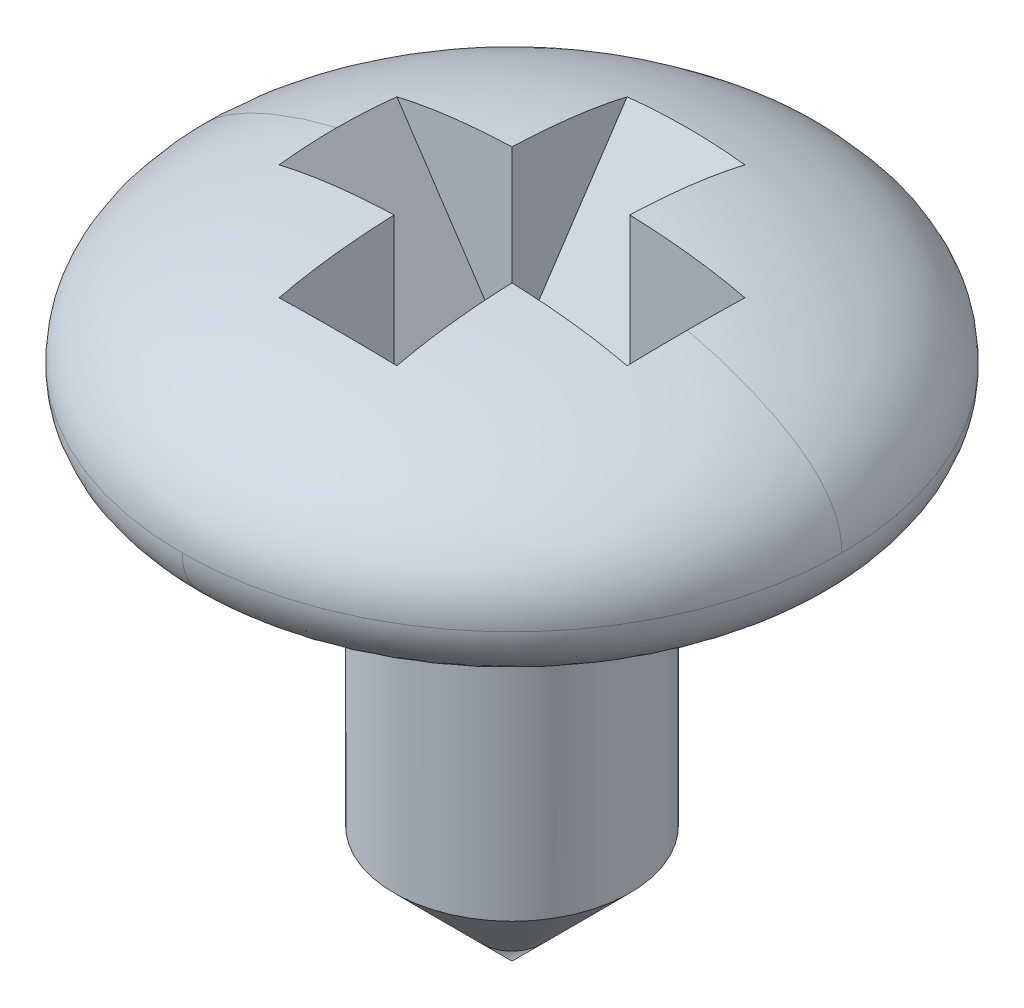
ISO-10303-21;
HEADER;
FILE_DESCRIPTION(('STEP AP214'),'2;1');
FILE_NAME('part.step','',(''),(''),'','','');
FILE_SCHEMA(('AUTOMOTIVE_DESIGN { 1 0 10303 214 1 1 1 1 }'));
ENDSEC;
DATA;
#1=APPLICATION_CONTEXT('core data for automotive mechanical design processes');
#2=APPLICATION_PROTOCOL_DEFINITION('international standard','automotive_design',2000,#1);
#3=PRODUCT_CONTEXT('',#1,'mechanical');
#4=PRODUCT('Part','Part','',(#3));
#5=PRODUCT_RELATED_PRODUCT_CATEGORY('part','',(#4));
#6=PRODUCT_DEFINITION_FORMATION('','',#4);
#7=PRODUCT_DEFINITION_CONTEXT('part definition',#1,'design');
#8=PRODUCT_DEFINITION('design','',#6,#7);
#9=PRODUCT_DEFINITION_SHAPE('','',#8);
#10=(LENGTH_UNIT() NAMED_UNIT(*) SI_UNIT(.MILLI.,.METRE.));
#11=(NAMED_UNIT(*) PLANE_ANGLE_UNIT() SI_UNIT($,.RADIAN.));
#12=(NAMED_UNIT(*) SI_UNIT($,.STERADIAN.) SOLID_ANGLE_UNIT());
#13=UNCERTAINTY_MEASURE_WITH_UNIT(LENGTH_MEASURE(1.E-05),#10,'distance_accuracy_value','');
#14=(GEOMETRIC_REPRESENTATION_CONTEXT(3) GLOBAL_UNCERTAINTY_ASSIGNED_CONTEXT((#13)) GLOBAL_UNIT_ASSIGNED_CONTEXT((#10,
#11,#12)) REPRESENTATION_CONTEXT('',''));
#15=CARTESIAN_POINT('',(0.,0.,0.));
#16=DIRECTION('',(0.,0.,1.));
#17=DIRECTION('',(1.,0.,0.));
#18=AXIS2_PLACEMENT_3D('',#15,#16,#17);
#19=CARTESIAN_POINT('',(0.5,6.390485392,1.482802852));
#20=DIRECTION('',(1.,0.,0.));
#21=DIRECTION('',(0.,0.,-1.));
#22=AXIS2_PLACEMENT_3D('',#19,#20,#21);
#23=PLANE('',#22);
#24=DIRECTION('',(0.,1.,0.));
#25=VECTOR('',#24,1.);
#26=CARTESIAN_POINT('',(0.5,7.192883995,0.5));
#27=LINE('',#26,#25);
#28=CARTESIAN_POINT('',(0.5,6.4000000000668,0.5));
#29=VERTEX_POINT('',#28);
#30=CARTESIAN_POINT('',(0.50000000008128,7.98576798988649,0.5));
#31=VERTEX_POINT('',#30);
#32=EDGE_CURVE('E110',#29,#31,#27,.T.);
#33=ORIENTED_EDGE('',*,*,#32,.F.);
#34=DIRECTION('',(0.,0.832050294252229,0.554700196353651));
#35=VECTOR('',#34,1.);
#36=CARTESIAN_POINT('',(0.5,7.1475827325,0.9983884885));
#37=LINE('',#36,#35);
#38=CARTESIAN_POINT('',(0.5,7.86541180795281,1.47694120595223));
#39=VERTEX_POINT('',#38);
#40=EDGE_CURVE('E130',#29,#39,#37,.T.);
#41=ORIENTED_EDGE('',*,*,#40,.T.);
#42=CARTESIAN_POINT('',(0.5,7.98576799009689,0.500000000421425));
#43=CARTESIAN_POINT('',(0.5,7.98363335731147,0.554809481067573));
#44=CARTESIAN_POINT('',(0.5,7.98099329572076,0.6096059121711));
#45=CARTESIAN_POINT('',(0.5,7.97444299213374,0.719017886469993));
#46=CARTESIAN_POINT('',(0.5,7.97053515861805,0.773633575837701));
#47=CARTESIAN_POINT('',(0.5,7.96118969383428,0.882669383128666));
#48=CARTESIAN_POINT('',(0.5,7.95575395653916,0.937089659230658));
#49=CARTESIAN_POINT('',(0.5,7.94310003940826,1.04574591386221));
#50=CARTESIAN_POINT('',(0.5,7.93588117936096,1.0999818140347));
#51=CARTESIAN_POINT('',(0.5,7.91942898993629,1.20819835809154));
#52=CARTESIAN_POINT('',(0.5,7.91019394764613,1.26217874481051));
#53=CARTESIAN_POINT('',(0.5,7.88950995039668,1.36984464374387));
#54=CARTESIAN_POINT('',(0.5,7.87805581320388,1.42352915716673));
#55=CARTESIAN_POINT('',(0.5,7.86541180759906,1.47694120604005));
#56=B_SPLINE_CURVE_WITH_KNOTS('',3,(#42,#43,#44,#45,#46,#47,#48,#49,#50,#51,#52,#53,#54,#55),
.UNSPECIFIED.,.F.,.F.,(4,2,2,2,2,2,4),(0.,0.164560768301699,0.328810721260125,0.492857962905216,
0.6569678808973,0.821217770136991,0.985855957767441),.UNSPECIFIED.);
#57=EDGE_CURVE('E20',#31,#39,#56,.T.);
#58=ORIENTED_EDGE('',*,*,#57,.F.);
#59=EDGE_LOOP('',(#33,#41,#58));
#60=FACE_BOUND('',#59,.T.);
#61=ADVANCED_FACE('F15',(#60),#23,.F.);
#62=CARTESIAN_POINT('',(-0.5,7.895165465,1.496776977));
#63=DIRECTION('',(0.,-0.554700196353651,0.832050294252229));
#64=DIRECTION('',(0.,-0.832050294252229,-0.554700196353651));
#65=AXIS2_PLACEMENT_3D('',#62,#63,#64);
#66=PLANE('',#65);
#67=ORIENTED_EDGE('',*,*,#40,.F.);
#68=DIRECTION('',(1.,0.,0.));
#69=VECTOR('',#68,1.);
#70=CARTESIAN_POINT('',(0.,6.4,0.5));
#71=LINE('',#70,#69);
#72=CARTESIAN_POINT('',(-0.5,6.40000000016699,0.499999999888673));
#73=VERTEX_POINT('',#72);
#74=EDGE_CURVE('E132',#73,#29,#71,.T.);
#75=ORIENTED_EDGE('',*,*,#74,.F.);
#76=DIRECTION('',(0.,-0.832050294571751,-0.554700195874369));
#77=VECTOR('',#76,1.);
#78=CARTESIAN_POINT('',(-0.5,7.86541180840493,1.47694120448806));
#79=LINE('',#78,#77);
#80=CARTESIAN_POINT('',(-0.49999999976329,7.86541180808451,1.47694120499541));
#81=VERTEX_POINT('',#80);
#82=EDGE_CURVE('E428',#81,#73,#79,.T.);
#83=ORIENTED_EDGE('',*,*,#82,.F.);
#84=CARTESIAN_POINT('',(0.499999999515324,7.86541180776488,1.47694120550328));
#85=CARTESIAN_POINT('',(0.444503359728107,7.86924704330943,1.47949802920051));
#86=CARTESIAN_POINT('',(0.388941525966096,7.87240994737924,1.48160663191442));
#87=CARTESIAN_POINT('',(0.277815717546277,7.87743427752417,1.48495618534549));
#88=CARTESIAN_POINT('',(0.222251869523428,7.87929763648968,1.48619842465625));
#89=CARTESIAN_POINT('',(0.111125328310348,7.88177630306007,1.48785086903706));
#90=CARTESIAN_POINT('',(0.0555626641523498,7.8823925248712,1.48826168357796));
#91=CARTESIAN_POINT('',(-0.0555626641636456,7.88239252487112,1.4882616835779));
#92=CARTESIAN_POINT('',(-0.111125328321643,7.88177630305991,1.48785086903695));
#93=CARTESIAN_POINT('',(-0.222251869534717,7.87929763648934,1.48619842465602));
#94=CARTESIAN_POINT('',(-0.277815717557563,7.87743427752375,1.48495618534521));
#95=CARTESIAN_POINT('',(-0.38894152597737,7.87240994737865,1.48160663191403));
#96=CARTESIAN_POINT('',(-0.444503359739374,7.86924704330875,1.47949802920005));
#97=CARTESIAN_POINT('',(-0.499999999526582,7.8654118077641,1.47694120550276));
#98=B_SPLINE_CURVE_WITH_KNOTS('',3,(#84,#85,#86,#87,#88,#89,#90,#91,#92,#93,#94,#95,#96,#97),
.UNSPECIFIED.,.F.,.F.,(4,2,2,2,2,2,4),(0.,0.16705445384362,0.333859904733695,0.50054303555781,
0.667226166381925,0.834031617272,1.00108607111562),.UNSPECIFIED.);
#99=EDGE_CURVE('E138',#39,#81,#98,.T.);
#100=ORIENTED_EDGE('',*,*,#99,.F.);
#101=EDGE_LOOP('',(#67,#75,#83,#100));
#102=FACE_BOUND('',#101,.T.);
#103=ADVANCED_FACE('F448',(#102),#66,.F.);
#104=CARTESIAN_POINT('',(-0.5,6.390485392,1.482802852));
#105=DIRECTION('',(1.,0.,0.));
#106=DIRECTION('',(0.,0.,-1.));
#107=AXIS2_PLACEMENT_3D('',#104,#105,#106);
#108=PLANE('',#107);
#109=DIRECTION('',(0.,-1.,0.));
#110=VECTOR('',#109,1.);
#111=CARTESIAN_POINT('',(-0.5,7.192883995,0.5));
#112=LINE('',#111,#110);
#113=CARTESIAN_POINT('',(-0.5,7.98576798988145,0.500000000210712));
#114=VERTEX_POINT('',#113);
#115=EDGE_CURVE('E414',#114,#73,#112,.T.);
#116=ORIENTED_EDGE('',*,*,#115,.F.);
#117=CARTESIAN_POINT('',(-0.5,7.98576799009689,0.500000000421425));
#118=CARTESIAN_POINT('',(-0.5,7.98363335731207,0.554809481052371));
#119=CARTESIAN_POINT('',(-0.5,7.98099329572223,0.609605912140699));
#120=CARTESIAN_POINT('',(-0.5,7.97444299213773,0.719017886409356));
#121=CARTESIAN_POINT('',(-0.5,7.97053515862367,0.773633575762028));
#122=CARTESIAN_POINT('',(-0.5,7.96118969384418,0.882669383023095));
#123=CARTESIAN_POINT('',(-0.5,7.95575395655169,0.937089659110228));
#124=CARTESIAN_POINT('',(-0.5,7.94310003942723,1.04574591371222));
#125=CARTESIAN_POINT('',(-0.5,7.93588117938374,1.09998181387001));
#126=CARTESIAN_POINT('',(-0.5,7.91942898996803,1.20819835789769));
#127=CARTESIAN_POINT('',(-0.5,7.91019394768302,1.26217874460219));
#128=CARTESIAN_POINT('',(-0.5,7.88950995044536,1.3698446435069));
#129=CARTESIAN_POINT('',(-0.5,7.87805581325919,1.42352915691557));
#130=CARTESIAN_POINT('',(-0.499999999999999,7.86541180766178,1.47694120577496));
#131=B_SPLINE_CURVE_WITH_KNOTS('',3,(#117,#118,#119,#120,#121,#122,#123,#124,#125,#126,#127,
#128,#129,#130),.UNSPECIFIED.,.F.,.F.,(4,2,2,2,2,2,4),(0.,0.164560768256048,0.328810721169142,
0.492857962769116,0.656967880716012,0.821217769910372,0.985855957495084),.UNSPECIFIED.);
#132=EDGE_CURVE('E425',#114,#81,#131,.T.);
#133=ORIENTED_EDGE('',*,*,#132,.T.);
#134=ORIENTED_EDGE('',*,*,#82,.T.);
#135=EDGE_LOOP('',(#116,#133,#134));
#136=FACE_BOUND('',#135,.T.);
#137=ADVANCED_FACE('F445',(#136),#108,.T.);
#138=CARTESIAN_POINT('',(-0.5,6.390485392,0.5));
#139=DIRECTION('',(0.,0.,-1.));
#140=DIRECTION('',(-1.,0.,0.));
#141=AXIS2_PLACEMENT_3D('',#138,#139,#140);
#142=PLANE('',#141);
#143=ORIENTED_EDGE('',*,*,#115,.T.);
#144=DIRECTION('',(-0.554700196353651,0.832050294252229,0.));
#145=VECTOR('',#144,1.);
#146=CARTESIAN_POINT('',(-0.9983884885,7.1475827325,0.5));
#147=LINE('',#146,#145);
#148=CARTESIAN_POINT('',(-1.47694120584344,7.86541180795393,0.5));
#149=VERTEX_POINT('',#148);
#150=EDGE_CURVE('E410',#73,#149,#147,.T.);
#151=ORIENTED_EDGE('',*,*,#150,.T.);
#152=CARTESIAN_POINT('',(-1.47694120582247,7.8654118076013,0.5));
#153=CARTESIAN_POINT('',(-1.42352915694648,7.87805581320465,0.5));
#154=CARTESIAN_POINT('',(-1.36984464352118,7.88950995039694,0.5));
#155=CARTESIAN_POINT('',(-1.26217874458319,7.91019394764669,0.5));
#156=CARTESIAN_POINT('',(-1.20819835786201,7.91942898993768,0.5));
#157=CARTESIAN_POINT('',(-1.09998181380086,7.93588117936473,0.5));
#158=CARTESIAN_POINT('',(-1.04574591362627,7.94310003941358,0.5));
#159=CARTESIAN_POINT('',(-0.937089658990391,7.9557539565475,0.5));
#160=CARTESIAN_POINT('',(-0.882669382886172,7.96118969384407,0.5));
#161=CARTESIAN_POINT('',(-0.773633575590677,7.97053515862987,0.5));
#162=CARTESIAN_POINT('',(-0.719017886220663,7.97444299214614,0.500000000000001));
#163=CARTESIAN_POINT('',(-0.609605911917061,7.98099329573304,0.499999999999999));
#164=CARTESIAN_POINT('',(-0.554809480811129,7.98363335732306,0.499999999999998));
#165=CARTESIAN_POINT('',(-0.500000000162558,7.98576799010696,0.499999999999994));
#166=B_SPLINE_CURVE_WITH_KNOTS('',3,(#152,#153,#154,#155,#156,#157,#158,#159,#160,#161,#162,
#163,#164,#165),.UNSPECIFIED.,.F.,.F.,(4,2,2,2,2,2,4),(0.,0.164638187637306,0.328888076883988,
0.492997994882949,0.657045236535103,0.82129518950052,0.985855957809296),.UNSPECIFIED.);
#167=EDGE_CURVE('E417',#149,#114,#166,.T.);
#168=ORIENTED_EDGE('',*,*,#167,.T.);
#169=EDGE_LOOP('',(#143,#151,#168));
#170=FACE_BOUND('',#169,.T.);
#171=ADVANCED_FACE('F442',(#170),#142,.T.);
#172=CARTESIAN_POINT('',(-1.496776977,7.895165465,-0.5));
#173=DIRECTION('',(-0.832050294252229,-0.554700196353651,0.));
#174=DIRECTION('',(0.554700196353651,-0.832050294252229,0.));
#175=AXIS2_PLACEMENT_3D('',#172,#173,#174);
#176=PLANE('',#175);
#177=CARTESIAN_POINT('',(-1.47694120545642,7.86541180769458,0.49999999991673));
#178=CARTESIAN_POINT('',(-1.47821963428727,7.86732945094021,0.472277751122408));
#179=CARTESIAN_POINT('',(-1.47938521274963,7.86907781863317,0.444538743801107));
#180=CARTESIAN_POINT('',(-1.48149537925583,7.87224306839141,0.389044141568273));
#181=CARTESIAN_POINT('',(-1.48244005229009,7.87366007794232,0.361288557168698));
#182=CARTESIAN_POINT('',(-1.48411394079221,7.87617091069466,0.305761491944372));
#183=CARTESIAN_POINT('',(-1.4848431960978,7.87726479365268,0.277990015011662));
#184=CARTESIAN_POINT('',(-1.48609040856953,7.87913561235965,0.222431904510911));
#185=CARTESIAN_POINT('',(-1.48660836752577,7.87991255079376,0.194645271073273));
#186=CARTESIAN_POINT('',(-1.48743609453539,7.88115414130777,0.139056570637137));
#187=CARTESIAN_POINT('',(-1.4877458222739,7.88161873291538,0.111254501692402));
#188=CARTESIAN_POINT('',(-1.48815854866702,7.88223782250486,0.0556349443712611));
#189=CARTESIAN_POINT('',(-1.48826146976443,7.88239220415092,0.0278174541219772));
#190=CARTESIAN_POINT('',(-1.48826168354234,7.88239252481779,0.));
#191=B_SPLINE_CURVE_WITH_KNOTS('',3,(#177,#178,#179,#180,#181,#182,#183,#184,#185,#186,#187,
#188,#189,#190),.UNSPECIFIED.,.F.,.F.,(4,2,2,2,2,2,4),(0.,0.0834526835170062,0.166873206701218,
0.25027829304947,0.333682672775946,0.417103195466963,0.500554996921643),.UNSPECIFIED.);
#192=CARTESIAN_POINT('',(-1.48826168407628,7.88239252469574,0.));
#193=VERTEX_POINT('',#192);
#194=EDGE_CURVE('E413',#149,#193,#191,.T.);
#195=ORIENTED_EDGE('',*,*,#194,.F.);
#196=ORIENTED_EDGE('',*,*,#150,.F.);
#197=DIRECTION('',(0.,0.,1.));
#198=VECTOR('',#197,1.);
#199=CARTESIAN_POINT('',(-0.5,6.4,0.));
#200=LINE('',#199,#198);
#201=CARTESIAN_POINT('',(-0.5,6.4,-0.5));
#202=VERTEX_POINT('',#201);
#203=EDGE_CURVE('E142',#202,#73,#200,.T.);
#204=ORIENTED_EDGE('',*,*,#203,.F.);
#205=DIRECTION('',(0.554700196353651,-0.832050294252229,0.));
#206=VECTOR('',#205,1.);
#207=CARTESIAN_POINT('',(-1.496776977,7.895165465,-0.5));
#208=LINE('',#207,#206);
#209=CARTESIAN_POINT('',(-1.47694120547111,7.86541180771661,-0.499999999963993));
#210=VERTEX_POINT('',#209);
#211=EDGE_CURVE('E246',#202,#210,#208,.F.);
#212=ORIENTED_EDGE('',*,*,#211,.T.);
#213=CARTESIAN_POINT('',(-1.48826168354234,7.88239252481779,0.));
#214=CARTESIAN_POINT('',(-1.48826146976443,7.88239220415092,-0.0278174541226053));
#215=CARTESIAN_POINT('',(-1.48815854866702,7.88223782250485,-0.0556349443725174));
#216=CARTESIAN_POINT('',(-1.48774582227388,7.88161873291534,-0.111254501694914));
#217=CARTESIAN_POINT('',(-1.48743609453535,7.88115414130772,-0.139056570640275));
#218=CARTESIAN_POINT('',(-1.4866083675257,7.87991255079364,-0.194645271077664));
#219=CARTESIAN_POINT('',(-1.48609040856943,7.87913561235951,-0.222431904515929));
#220=CARTESIAN_POINT('',(-1.48484319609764,7.87726479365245,-0.277990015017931));
#221=CARTESIAN_POINT('',(-1.48411394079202,7.87617091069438,-0.305761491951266));
#222=CARTESIAN_POINT('',(-1.48244005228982,7.87366007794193,-0.36128855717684));
#223=CARTESIAN_POINT('',(-1.48149537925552,7.87224306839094,-0.389044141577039));
#224=CARTESIAN_POINT('',(-1.47938521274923,7.86907781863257,-0.44453874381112));
#225=CARTESIAN_POINT('',(-1.47821963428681,7.86732945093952,-0.472277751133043));
#226=CARTESIAN_POINT('',(-1.4769412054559,7.8654118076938,-0.499999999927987));
#227=B_SPLINE_CURVE_WITH_KNOTS('',3,(#213,#214,#215,#216,#217,#218,#219,#220,#221,#222,#223,
#224,#225,#226),.UNSPECIFIED.,.F.,.F.,(4,2,2,2,2,2,4),(0.,0.0834518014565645,0.166872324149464,
0.25027670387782,0.333681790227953,0.417102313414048,0.500554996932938),.UNSPECIFIED.);
#228=EDGE_CURVE('E464',#193,#210,#227,.T.);
#229=ORIENTED_EDGE('',*,*,#228,.F.);
#230=EDGE_LOOP('',(#195,#196,#204,#212,#229));
#231=FACE_BOUND('',#230,.T.);
#232=ADVANCED_FACE('F252',(#231),#176,.F.);
#233=CARTESIAN_POINT('',(-0.5,6.390485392,-0.5));
#234=DIRECTION('',(0.,0.,-1.));
#235=DIRECTION('',(-1.,0.,0.));
#236=AXIS2_PLACEMENT_3D('',#233,#234,#235);
#237=PLANE('',#236);
#238=CARTESIAN_POINT('',(-1.47694120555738,7.86541180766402,-0.5));
#239=CARTESIAN_POINT('',(-1.42352915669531,7.87805581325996,-0.5));
#240=CARTESIAN_POINT('',(-1.36984464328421,7.88950995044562,-0.5));
#241=CARTESIAN_POINT('',(-1.26217874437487,7.91019394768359,-0.5));
#242=CARTESIAN_POINT('',(-1.20819835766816,7.91942898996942,-0.5));
#243=CARTESIAN_POINT('',(-1.09998181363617,7.93588117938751,-0.5));
#244=CARTESIAN_POINT('',(-1.04574591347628,7.94310003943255,-0.5));
#245=CARTESIAN_POINT('',(-0.937089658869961,7.95575395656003,-0.5));
#246=CARTESIAN_POINT('',(-0.882669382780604,7.96118969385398,-0.5));
#247=CARTESIAN_POINT('',(-0.773633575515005,7.9705351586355,-0.5));
#248=CARTESIAN_POINT('',(-0.719017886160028,7.97444299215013,-0.500000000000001));
#249=CARTESIAN_POINT('',(-0.609605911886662,7.98099329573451,-0.499999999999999));
#250=CARTESIAN_POINT('',(-0.554809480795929,7.98363335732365,-0.499999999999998));
#251=CARTESIAN_POINT('',(-0.500000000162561,7.98576799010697,-0.499999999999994));
#252=B_SPLINE_CURVE_WITH_KNOTS('',3,(#238,#239,#240,#241,#242,#243,#244,#245,#246,#247,#248,
#249,#250,#251),.UNSPECIFIED.,.F.,.F.,(4,2,2,2,2,2,4),(0.,0.164638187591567,0.328888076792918,
0.492997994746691,0.657045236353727,0.821295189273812,0.985855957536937),.UNSPECIFIED.);
#253=CARTESIAN_POINT('',(-0.500000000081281,7.98576798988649,-0.5));
#254=VERTEX_POINT('',#253);
#255=EDGE_CURVE('E239',#210,#254,#252,.T.);
#256=ORIENTED_EDGE('',*,*,#255,.F.);
#257=ORIENTED_EDGE('',*,*,#211,.F.);
#258=DIRECTION('',(0.,-1.,0.));
#259=VECTOR('',#258,1.);
#260=CARTESIAN_POINT('',(-0.5,7.192883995,-0.5));
#261=LINE('',#260,#259);
#262=EDGE_CURVE('E245',#254,#202,#261,.T.);
#263=ORIENTED_EDGE('',*,*,#262,.F.);
#264=EDGE_LOOP('',(#256,#257,#263));
#265=FACE_BOUND('',#264,.T.);
#266=ADVANCED_FACE('F247',(#265),#237,.F.);
#267=CARTESIAN_POINT('',(-0.5,6.390485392,-0.5));
#268=DIRECTION('',(1.,0.,0.));
#269=DIRECTION('',(0.,0.,-1.));
#270=AXIS2_PLACEMENT_3D('',#267,#268,#269);
#271=PLANE('',#270);
#272=DIRECTION('',(0.,0.832050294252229,-0.554700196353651));
#273=VECTOR('',#272,1.);
#274=CARTESIAN_POINT('',(-0.5,7.1475827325,-0.9983884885));
#275=LINE('',#274,#273);
#276=CARTESIAN_POINT('',(-0.5,7.86541180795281,-1.47694120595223));
#277=VERTEX_POINT('',#276);
#278=EDGE_CURVE('E403',#202,#277,#275,.T.);
#279=ORIENTED_EDGE('',*,*,#278,.T.);
#280=CARTESIAN_POINT('',(-0.5,7.86541180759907,-1.47694120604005));
#281=CARTESIAN_POINT('',(-0.5,7.87805581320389,-1.42352915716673));
#282=CARTESIAN_POINT('',(-0.5,7.88950995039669,-1.36984464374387));
#283=CARTESIAN_POINT('',(-0.5,7.91019394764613,-1.26217874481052));
#284=CARTESIAN_POINT('',(-0.5,7.91942898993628,-1.20819835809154));
#285=CARTESIAN_POINT('',(-0.5,7.93588117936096,-1.0999818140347));
#286=CARTESIAN_POINT('',(-0.5,7.94310003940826,-1.04574591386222));
#287=CARTESIAN_POINT('',(-0.5,7.95575395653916,-0.937089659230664));
#288=CARTESIAN_POINT('',(-0.5,7.96118969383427,-0.882669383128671));
#289=CARTESIAN_POINT('',(-0.5,7.97053515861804,-0.773633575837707));
#290=CARTESIAN_POINT('',(-0.500000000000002,7.97444299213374,-0.719017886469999));
#291=CARTESIAN_POINT('',(-0.499999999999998,7.98099329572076,-0.609605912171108));
#292=CARTESIAN_POINT('',(-0.499999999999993,7.98363335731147,-0.55480948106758));
#293=CARTESIAN_POINT('',(-0.499999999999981,7.98576799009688,-0.500000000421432));
#294=B_SPLINE_CURVE_WITH_KNOTS('',3,(#280,#281,#282,#283,#284,#285,#286,#287,#288,#289,#290,
#291,#292,#293),.UNSPECIFIED.,.F.,.F.,(4,2,2,2,2,2,4),(0.,0.164638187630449,0.328888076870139,
0.492997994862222,0.657045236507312,0.821295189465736,0.985855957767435),.UNSPECIFIED.);
#295=EDGE_CURVE('E233',#277,#254,#294,.T.);
#296=ORIENTED_EDGE('',*,*,#295,.T.);
#297=ORIENTED_EDGE('',*,*,#262,.T.);
#298=EDGE_LOOP('',(#279,#296,#297));
#299=FACE_BOUND('',#298,.T.);
#300=ADVANCED_FACE('F251',(#299),#271,.T.);
#301=CARTESIAN_POINT('',(-0.5,6.4,-0.5));
#302=DIRECTION('',(0.,-0.554700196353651,-0.832050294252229));
#303=DIRECTION('',(0.,0.832050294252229,-0.554700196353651));
#304=AXIS2_PLACEMENT_3D('',#301,#302,#303);
#305=PLANE('',#304);
#306=ORIENTED_EDGE('',*,*,#278,.F.);
#307=DIRECTION('',(-1.,0.,0.));
#308=VECTOR('',#307,1.);
#309=CARTESIAN_POINT('',(0.,6.4,-0.5));
#310=LINE('',#309,#308);
#311=CARTESIAN_POINT('',(0.5,6.4,-0.5));
#312=VERTEX_POINT('',#311);
#313=EDGE_CURVE('E285',#312,#202,#310,.T.);
#314=ORIENTED_EDGE('',*,*,#313,.F.);
#315=DIRECTION('',(0.,0.832050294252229,-0.554700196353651));
#316=VECTOR('',#315,1.);
#317=CARTESIAN_POINT('',(0.5,6.4,-0.5));
#318=LINE('',#317,#316);
#319=CARTESIAN_POINT('',(0.499999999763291,7.86541180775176,-1.47694120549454));
#320=VERTEX_POINT('',#319);
#321=EDGE_CURVE('E568',#312,#320,#318,.T.);
#322=ORIENTED_EDGE('',*,*,#321,.T.);
#323=CARTESIAN_POINT('',(-0.499999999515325,7.86541180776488,-1.47694120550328));
#324=CARTESIAN_POINT('',(-0.444503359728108,7.86924704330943,-1.47949802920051));
#325=CARTESIAN_POINT('',(-0.388941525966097,7.87240994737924,-1.48160663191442));
#326=CARTESIAN_POINT('',(-0.277815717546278,7.87743427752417,-1.48495618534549));
#327=CARTESIAN_POINT('',(-0.222251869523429,7.87929763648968,-1.48619842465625));
#328=CARTESIAN_POINT('',(-0.111125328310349,7.88177630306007,-1.48785086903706));
#329=CARTESIAN_POINT('',(-0.0555626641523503,7.8823925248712,-1.48826168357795));
#330=CARTESIAN_POINT('',(0.0555626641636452,7.88239252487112,-1.4882616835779));
#331=CARTESIAN_POINT('',(0.111125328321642,7.88177630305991,-1.48785086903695));
#332=CARTESIAN_POINT('',(0.222251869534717,7.87929763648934,-1.48619842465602));
#333=CARTESIAN_POINT('',(0.277815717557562,7.87743427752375,-1.48495618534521));
#334=CARTESIAN_POINT('',(0.38894152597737,7.87240994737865,-1.48160663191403));
#335=CARTESIAN_POINT('',(0.444503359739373,7.86924704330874,-1.47949802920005));
#336=CARTESIAN_POINT('',(0.499999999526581,7.8654118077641,-1.47694120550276));
#337=B_SPLINE_CURVE_WITH_KNOTS('',3,(#323,#324,#325,#326,#327,#328,#329,#330,#331,#332,#333,
#334,#335,#336),.UNSPECIFIED.,.F.,.F.,(4,2,2,2,2,2,4),(0.,0.16705445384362,0.333859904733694,
0.50054303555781,0.667226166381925,0.834031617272,1.00108607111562),.UNSPECIFIED.);
#338=EDGE_CURVE('E227',#277,#320,#337,.T.);
#339=ORIENTED_EDGE('',*,*,#338,.F.);
#340=EDGE_LOOP('',(#306,#314,#322,#339));
#341=FACE_BOUND('',#340,.T.);
#342=ADVANCED_FACE('F258',(#341),#305,.F.);
#343=CARTESIAN_POINT('',(0.,2.5,0.));
#344=DIRECTION('',(0.,1.,0.));
#345=DIRECTION('',(-1.,0.,0.));
#346=AXIS2_PLACEMENT_3D('',#343,#344,#345);
#347=CONICAL_SURFACE('',#346,0.,0.785398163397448);
#348=CARTESIAN_POINT('',(0.,2.5,0.));
#349=VERTEX_POINT('',#348);
#350=VERTEX_LOOP('',#349);
#351=FACE_BOUND('',#350,.T.);
#352=CARTESIAN_POINT('',(0.,3.5,0.));
#353=DIRECTION('',(0.,-1.,0.));
#354=DIRECTION('',(0.,0.,-1.));
#355=AXIS2_PLACEMENT_3D('',#352,#353,#354);
#356=CIRCLE('',#355,1.);
#357=CARTESIAN_POINT('',(0.,3.5,-1.));
#358=VERTEX_POINT('',#357);
#359=EDGE_CURVE('E128',#358,#358,#356,.T.);
#360=ORIENTED_EDGE('',*,*,#359,.T.);
#361=EDGE_LOOP('',(#360));
#362=FACE_BOUND('',#361,.T.);
#363=ADVANCED_FACE('F262',(#351,#362),#347,.T.);
#364=CARTESIAN_POINT('',(0.5,6.390485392,-0.5));
#365=DIRECTION('',(1.,0.,0.));
#366=DIRECTION('',(0.,0.,-1.));
#367=AXIS2_PLACEMENT_3D('',#364,#365,#366);
#368=PLANE('',#367);
#369=ORIENTED_EDGE('',*,*,#321,.F.);
#370=DIRECTION('',(0.,1.,0.));
#371=VECTOR('',#370,1.);
#372=CARTESIAN_POINT('',(0.5,7.192883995,-0.5));
#373=LINE('',#372,#371);
#374=CARTESIAN_POINT('',(0.5,7.98576798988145,-0.500000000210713));
#375=VERTEX_POINT('',#374);
#376=EDGE_CURVE('E127',#312,#375,#373,.T.);
#377=ORIENTED_EDGE('',*,*,#376,.T.);
#378=CARTESIAN_POINT('',(0.5,7.86541180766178,-1.47694120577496));
#379=CARTESIAN_POINT('',(0.5,7.8780558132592,-1.42352915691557));
#380=CARTESIAN_POINT('',(0.5,7.88950995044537,-1.3698446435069));
#381=CARTESIAN_POINT('',(0.5,7.91019394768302,-1.26217874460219));
#382=CARTESIAN_POINT('',(0.5,7.91942898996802,-1.20819835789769));
#383=CARTESIAN_POINT('',(0.5,7.93588117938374,-1.09998181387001));
#384=CARTESIAN_POINT('',(0.5,7.94310003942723,-1.04574591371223));
#385=CARTESIAN_POINT('',(0.5,7.95575395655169,-0.937089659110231));
#386=CARTESIAN_POINT('',(0.5,7.96118969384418,-0.8826693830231));
#387=CARTESIAN_POINT('',(0.5,7.97053515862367,-0.773633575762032));
#388=CARTESIAN_POINT('',(0.500000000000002,7.97444299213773,-0.719017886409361));
#389=CARTESIAN_POINT('',(0.499999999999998,7.98099329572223,-0.609605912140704));
#390=CARTESIAN_POINT('',(0.499999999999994,7.98363335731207,-0.554809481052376));
#391=CARTESIAN_POINT('',(0.499999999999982,7.98576799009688,-0.50000000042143));
#392=B_SPLINE_CURVE_WITH_KNOTS('',3,(#378,#379,#380,#381,#382,#383,#384,#385,#386,#387,#388,
#389,#390,#391),.UNSPECIFIED.,.F.,.F.,(4,2,2,2,2,2,4),(0.,0.164638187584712,0.328888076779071,
0.492997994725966,0.657045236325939,0.821295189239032,0.98585595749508),.UNSPECIFIED.);
#393=EDGE_CURVE('E219',#320,#375,#392,.T.);
#394=ORIENTED_EDGE('',*,*,#393,.F.);
#395=EDGE_LOOP('',(#369,#377,#394));
#396=FACE_BOUND('',#395,.T.);
#397=ADVANCED_FACE('F264',(#396),#368,.F.);
#398=CARTESIAN_POINT('',(0.,6.4,0.));
#399=DIRECTION('',(0.,-1.,0.));
#400=DIRECTION('',(0.,0.,-1.));
#401=AXIS2_PLACEMENT_3D('',#398,#399,#400);
#402=CYLINDRICAL_SURFACE('',#401,1.);
#403=ORIENTED_EDGE('',*,*,#359,.F.);
#404=EDGE_LOOP('',(#403));
#405=FACE_BOUND('',#404,.T.);
#406=CARTESIAN_POINT('',(0.,6.4,0.));
#407=DIRECTION('',(0.,-1.,0.));
#408=DIRECTION('',(0.,0.,-1.));
#409=AXIS2_PLACEMENT_3D('',#406,#407,#408);
#410=CIRCLE('',#409,1.);
#411=CARTESIAN_POINT('',(0.,6.4,-1.));
#412=VERTEX_POINT('',#411);
#413=EDGE_CURVE('E303',#412,#412,#410,.F.);
#414=ORIENTED_EDGE('',*,*,#413,.F.);
#415=EDGE_LOOP('',(#414));
#416=FACE_BOUND('',#415,.T.);
#417=ADVANCED_FACE('F268',(#405,#416),#402,.T.);
#418=CARTESIAN_POINT('',(1.482802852,6.390485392,0.5));
#419=DIRECTION('',(0.,0.,-1.));
#420=DIRECTION('',(-1.,0.,0.));
#421=AXIS2_PLACEMENT_3D('',#418,#419,#420);
#422=PLANE('',#421);
#423=CARTESIAN_POINT('',(0.50000000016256,7.98576799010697,0.5));
#424=CARTESIAN_POINT('',(0.554809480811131,7.98363335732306,0.5));
#425=CARTESIAN_POINT('',(0.609605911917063,7.98099329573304,0.5));
#426=CARTESIAN_POINT('',(0.719017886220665,7.97444299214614,0.5));
#427=CARTESIAN_POINT('',(0.773633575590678,7.97053515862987,0.5));
#428=CARTESIAN_POINT('',(0.882669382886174,7.96118969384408,0.5));
#429=CARTESIAN_POINT('',(0.937089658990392,7.9557539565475,0.5));
#430=CARTESIAN_POINT('',(1.04574591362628,7.94310003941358,0.5));
#431=CARTESIAN_POINT('',(1.09998181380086,7.93588117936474,0.5));
#432=CARTESIAN_POINT('',(1.20819835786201,7.91942898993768,0.5));
#433=CARTESIAN_POINT('',(1.26217874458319,7.9101939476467,0.5));
#434=CARTESIAN_POINT('',(1.36984464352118,7.88950995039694,0.5));
#435=CARTESIAN_POINT('',(1.42352915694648,7.87805581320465,0.5));
#436=CARTESIAN_POINT('',(1.47694120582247,7.8654118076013,0.499999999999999));
#437=B_SPLINE_CURVE_WITH_KNOTS('',3,(#423,#424,#425,#426,#427,#428,#429,#430,#431,#432,#433,
#434,#435,#436),.UNSPECIFIED.,.F.,.F.,(4,2,2,2,2,2,4),(0.,0.164560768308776,0.328810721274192,
0.492857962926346,0.656967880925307,0.821217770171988,0.985855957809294),.UNSPECIFIED.);
#438=CARTESIAN_POINT('',(1.47694120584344,7.86541180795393,0.5));
#439=VERTEX_POINT('',#438);
#440=EDGE_CURVE('E113',#31,#439,#437,.T.);
#441=ORIENTED_EDGE('',*,*,#440,.T.);
#442=DIRECTION('',(-0.554700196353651,-0.832050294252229,0.));
#443=VECTOR('',#442,1.);
#444=CARTESIAN_POINT('',(0.9983884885,7.1475827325,0.5));
#445=LINE('',#444,#443);
#446=EDGE_CURVE('E115',#439,#29,#445,.T.);
#447=ORIENTED_EDGE('',*,*,#446,.T.);
#448=ORIENTED_EDGE('',*,*,#32,.T.);
#449=EDGE_LOOP('',(#441,#447,#448));
#450=FACE_BOUND('',#449,.T.);
#451=ADVANCED_FACE('F112',(#450),#422,.T.);
#452=CARTESIAN_POINT('',(-0.5,6.4,0.5));
#453=DIRECTION('',(0.,-1.,0.));
#454=DIRECTION('',(0.,0.,-1.));
#455=AXIS2_PLACEMENT_3D('',#452,#453,#454);
#456=PLANE('',#455);
#457=DIRECTION('',(0.,0.,-1.));
#458=VECTOR('',#457,1.);
#459=CARTESIAN_POINT('',(0.5,6.4,0.));
#460=LINE('',#459,#458);
#461=EDGE_CURVE('E283',#29,#312,#460,.T.);
#462=ORIENTED_EDGE('',*,*,#461,.T.);
#463=ORIENTED_EDGE('',*,*,#313,.T.);
#464=ORIENTED_EDGE('',*,*,#203,.T.);
#465=ORIENTED_EDGE('',*,*,#74,.T.);
#466=EDGE_LOOP('',(#462,#463,#464,#465));
#467=FACE_BOUND('',#466,.T.);
#468=ADVANCED_FACE('F272',(#467),#456,.F.);
#469=CARTESIAN_POINT('',(1.482802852,6.390485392,-0.5));
#470=DIRECTION('',(0.,0.,-1.));
#471=DIRECTION('',(-1.,0.,0.));
#472=AXIS2_PLACEMENT_3D('',#469,#470,#471);
#473=PLANE('',#472);
#474=ORIENTED_EDGE('',*,*,#376,.F.);
#475=DIRECTION('',(0.554700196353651,0.832050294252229,0.));
#476=VECTOR('',#475,1.);
#477=CARTESIAN_POINT('',(0.9983884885,7.1475827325,-0.5));
#478=LINE('',#477,#476);
#479=CARTESIAN_POINT('',(1.47694120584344,7.86541180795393,-0.5));
#480=VERTEX_POINT('',#479);
#481=EDGE_CURVE('E289',#312,#480,#478,.T.);
#482=ORIENTED_EDGE('',*,*,#481,.T.);
#483=CARTESIAN_POINT('',(0.500000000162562,7.98576799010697,-0.5));
#484=CARTESIAN_POINT('',(0.554809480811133,7.98363335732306,-0.5));
#485=CARTESIAN_POINT('',(0.609605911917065,7.98099329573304,-0.5));
#486=CARTESIAN_POINT('',(0.719017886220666,7.97444299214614,-0.5));
#487=CARTESIAN_POINT('',(0.77363357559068,7.97053515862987,-0.5));
#488=CARTESIAN_POINT('',(0.882669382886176,7.96118969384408,-0.5));
#489=CARTESIAN_POINT('',(0.937089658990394,7.95575395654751,-0.5));
#490=CARTESIAN_POINT('',(1.04574591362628,7.94310003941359,-0.5));
#491=CARTESIAN_POINT('',(1.09998181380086,7.93588117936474,-0.5));
#492=CARTESIAN_POINT('',(1.20819835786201,7.91942898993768,-0.5));
#493=CARTESIAN_POINT('',(1.26217874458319,7.9101939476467,-0.5));
#494=CARTESIAN_POINT('',(1.36984464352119,7.88950995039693,-0.5));
#495=CARTESIAN_POINT('',(1.42352915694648,7.87805581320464,-0.5));
#496=CARTESIAN_POINT('',(1.47694120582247,7.8654118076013,-0.5));
#497=B_SPLINE_CURVE_WITH_KNOTS('',3,(#483,#484,#485,#486,#487,#488,#489,#490,#491,#492,#493,
#494,#495,#496),.UNSPECIFIED.,.F.,.F.,(4,2,2,2,2,2,4),(0.,0.164560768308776,0.328810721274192,
0.492857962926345,0.656967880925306,0.821217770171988,0.985855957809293),.UNSPECIFIED.);
#498=EDGE_CURVE('E213',#375,#480,#497,.T.);
#499=ORIENTED_EDGE('',*,*,#498,.F.);
#500=EDGE_LOOP('',(#474,#482,#499));
#501=FACE_BOUND('',#500,.T.);
#502=ADVANCED_FACE('F164',(#501),#473,.F.);
#503=CARTESIAN_POINT('',(-2.327600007,6.4,2.327600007));
#504=DIRECTION('',(0.,-1.,0.));
#505=DIRECTION('',(0.,0.,-1.));
#506=AXIS2_PLACEMENT_3D('',#503,#504,#505);
#507=PLANE('',#506);
#508=ORIENTED_EDGE('',*,*,#413,.T.);
#509=EDGE_LOOP('',(#508));
#510=FACE_BOUND('',#509,.T.);
#511=CARTESIAN_POINT('',(0.,6.39999999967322,2.30000000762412));
#512=CARTESIAN_POINT('',(4.60000001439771,6.39999999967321,2.30000000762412));
#513=CARTESIAN_POINT('',(4.60000001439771,6.39999999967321,-2.30000000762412));
#514=CARTESIAN_POINT('',(0.,6.39999999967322,-2.30000000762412));
#515=(BOUNDED_CURVE() B_SPLINE_CURVE(3,(#511,#512,#513,#514),.UNSPECIFIED.,.F.,
.F.) B_SPLINE_CURVE_WITH_KNOTS((4,4),(0.,1.),
.UNSPECIFIED.) CURVE() GEOMETRIC_REPRESENTATION_ITEM() RATIONAL_B_SPLINE_CURVE((0.956573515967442,
0.318857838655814,0.318857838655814,0.956573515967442)) REPRESENTATION_ITEM(''));
#516=CARTESIAN_POINT('',(0.,6.39999999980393,2.30000000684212));
#517=VERTEX_POINT('',#516);
#518=CARTESIAN_POINT('',(0.,6.39999999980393,-2.30000000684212));
#519=VERTEX_POINT('',#518);
#520=EDGE_CURVE('E149',#517,#519,#515,.T.);
#521=ORIENTED_EDGE('',*,*,#520,.F.);
#522=CARTESIAN_POINT('',(0.,6.39999999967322,-2.30000000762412));
#523=CARTESIAN_POINT('',(-4.60000001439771,6.39999999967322,-2.30000000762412));
#524=CARTESIAN_POINT('',(-4.60000001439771,6.39999999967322,2.30000000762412));
#525=CARTESIAN_POINT('',(0.,6.39999999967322,2.30000000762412));
#526=(BOUNDED_CURVE() B_SPLINE_CURVE(3,(#522,#523,#524,#525),.UNSPECIFIED.,.F.,
.F.) B_SPLINE_CURVE_WITH_KNOTS((4,4),(0.,1.),
.UNSPECIFIED.) CURVE() GEOMETRIC_REPRESENTATION_ITEM() RATIONAL_B_SPLINE_CURVE((0.956573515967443,
0.318857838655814,0.318857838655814,0.956573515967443)) REPRESENTATION_ITEM(''));
#527=EDGE_CURVE('E332',#519,#517,#526,.T.);
#528=ORIENTED_EDGE('',*,*,#527,.F.);
#529=EDGE_LOOP('',(#521,#528));
#530=FACE_BOUND('',#529,.T.);
#531=ADVANCED_FACE('F155',(#510,#530),#507,.T.);
#532=CARTESIAN_POINT('',(0.5,6.4,-0.5));
#533=DIRECTION('',(0.832050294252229,-0.554700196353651,0.));
#534=DIRECTION('',(0.554700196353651,0.832050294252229,0.));
#535=AXIS2_PLACEMENT_3D('',#532,#533,#534);
#536=PLANE('',#535);
#537=CARTESIAN_POINT('',(1.47694120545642,7.86541180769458,-0.49999999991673));
#538=CARTESIAN_POINT('',(1.47821963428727,7.86732945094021,-0.472277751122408));
#539=CARTESIAN_POINT('',(1.47938521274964,7.86907781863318,-0.444538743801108));
#540=CARTESIAN_POINT('',(1.48149537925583,7.87224306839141,-0.389044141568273));
#541=CARTESIAN_POINT('',(1.48244005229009,7.87366007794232,-0.361288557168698));
#542=CARTESIAN_POINT('',(1.4841139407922,7.87617091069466,-0.305761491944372));
#543=CARTESIAN_POINT('',(1.4848431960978,7.87726479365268,-0.277990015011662));
#544=CARTESIAN_POINT('',(1.48609040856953,7.87913561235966,-0.222431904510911));
#545=CARTESIAN_POINT('',(1.48660836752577,7.87991255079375,-0.194645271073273));
#546=CARTESIAN_POINT('',(1.48743609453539,7.88115414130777,-0.139056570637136));
#547=CARTESIAN_POINT('',(1.4877458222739,7.88161873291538,-0.111254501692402));
#548=CARTESIAN_POINT('',(1.48815854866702,7.88223782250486,-0.0556349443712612));
#549=CARTESIAN_POINT('',(1.48826146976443,7.88239220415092,-0.0278174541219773));
#550=CARTESIAN_POINT('',(1.48826168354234,7.88239252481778,0.));
#551=B_SPLINE_CURVE_WITH_KNOTS('',3,(#537,#538,#539,#540,#541,#542,#543,#544,#545,#546,#547,
#548,#549,#550),.UNSPECIFIED.,.F.,.F.,(4,2,2,2,2,2,4),(0.,0.0834526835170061,0.166873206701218,
0.25027829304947,0.333682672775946,0.417103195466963,0.500554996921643),.UNSPECIFIED.);
#552=CARTESIAN_POINT('',(1.48826168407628,7.88239252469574,0.));
#553=VERTEX_POINT('',#552);
#554=EDGE_CURVE('E172',#480,#553,#551,.T.);
#555=ORIENTED_EDGE('',*,*,#554,.F.);
#556=ORIENTED_EDGE('',*,*,#481,.F.);
#557=ORIENTED_EDGE('',*,*,#461,.F.);
#558=ORIENTED_EDGE('',*,*,#446,.F.);
#559=CARTESIAN_POINT('',(1.48826168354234,7.88239252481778,0.));
#560=CARTESIAN_POINT('',(1.48826146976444,7.88239220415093,0.0278174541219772));
#561=CARTESIAN_POINT('',(1.48815854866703,7.88223782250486,0.0556349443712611));
#562=CARTESIAN_POINT('',(1.4877458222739,7.88161873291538,0.111254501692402));
#563=CARTESIAN_POINT('',(1.48743609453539,7.88115414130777,0.139056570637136));
#564=CARTESIAN_POINT('',(1.48660836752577,7.87991255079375,0.194645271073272));
#565=CARTESIAN_POINT('',(1.48609040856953,7.87913561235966,0.222431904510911));
#566=CARTESIAN_POINT('',(1.4848431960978,7.87726479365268,0.277990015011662));
#567=CARTESIAN_POINT('',(1.48411394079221,7.87617091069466,0.305761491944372));
#568=CARTESIAN_POINT('',(1.48244005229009,7.87366007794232,0.361288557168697));
#569=CARTESIAN_POINT('',(1.48149537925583,7.8722430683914,0.389044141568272));
#570=CARTESIAN_POINT('',(1.47938521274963,7.86907781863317,0.444538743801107));
#571=CARTESIAN_POINT('',(1.47821963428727,7.86732945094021,0.472277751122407));
#572=CARTESIAN_POINT('',(1.47694120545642,7.86541180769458,0.49999999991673));
#573=B_SPLINE_CURVE_WITH_KNOTS('',3,(#559,#560,#561,#562,#563,#564,#565,#566,#567,#568,#569,
#570,#571,#572),.UNSPECIFIED.,.F.,.F.,(4,2,2,2,2,2,4),(0.,0.08345180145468,0.166872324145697,
0.250276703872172,0.333681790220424,0.417102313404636,0.500554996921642),.UNSPECIFIED.);
#574=EDGE_CURVE('E126',#553,#439,#573,.T.);
#575=ORIENTED_EDGE('',*,*,#574,.F.);
#576=EDGE_LOOP('',(#555,#556,#557,#558,#575));
#577=FACE_BOUND('',#576,.T.);
#578=ADVANCED_FACE('F17',(#577),#536,.F.);
#579=CARTESIAN_POINT('',(0.,6.949999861,2.797493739));
#580=CARTESIAN_POINT('',(5.594987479,6.949999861,2.797493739));
#581=CARTESIAN_POINT('',(5.594987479,6.949999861,-2.797493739));
#582=CARTESIAN_POINT('',(0.,6.949999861,-2.797493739));
#583=CARTESIAN_POINT('',(0.,6.610019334,2.831662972));
#584=CARTESIAN_POINT('',(5.663325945,6.610019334,2.831662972));
#585=CARTESIAN_POINT('',(5.663325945,6.610019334,-2.831662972));
#586=CARTESIAN_POINT('',(0.,6.610019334,-2.831662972));
#587=CARTESIAN_POINT('',(0.,6.36838551,2.590069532));
#588=CARTESIAN_POINT('',(5.180139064,6.36838551,2.590069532));
#589=CARTESIAN_POINT('',(5.180139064,6.36838551,-2.590069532));
#590=CARTESIAN_POINT('',(0.,6.36838551,-2.590069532));
#591=CARTESIAN_POINT('',(0.,6.402497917,2.250083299));
#592=CARTESIAN_POINT('',(4.500166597,6.402497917,2.250083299));
#593=CARTESIAN_POINT('',(4.500166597,6.402497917,-2.250083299));
#594=CARTESIAN_POINT('',(0.,6.402497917,-2.250083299));
#595=(BOUNDED_SURFACE() B_SPLINE_SURFACE(3,3,((#579,#580,#581,#582),(#583,#584,#585,#586),(#587,
#588,#589,#590),(#591,#592,#593,#594)),.UNSPECIFIED.,.F.,.F.,
.F.) B_SPLINE_SURFACE_WITH_KNOTS((4,4),(4,4),(0.,1.),(0.,1.),
.UNSPECIFIED.) GEOMETRIC_REPRESENTATION_ITEM() RATIONAL_B_SPLINE_SURFACE(((1.,0.333333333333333,
0.333333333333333,1.),(0.755277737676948,0.251759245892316,0.251759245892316,0.755277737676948),
(0.755277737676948,0.251759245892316,0.251759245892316,0.755277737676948),(1.,0.333333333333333,
0.333333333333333,1.))) REPRESENTATION_ITEM('') SURFACE());
#596=CARTESIAN_POINT('',(0.,6.900083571,0.));
#597=DIRECTION('',(0.,1.,0.));
#598=DIRECTION('',(0.,0.,1.));
#599=AXIS2_PLACEMENT_3D('',#596,#597,#598);
#600=CIRCLE('',#599,2.8);
#601=CARTESIAN_POINT('',(0.,6.90008357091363,2.79999999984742));
#602=VERTEX_POINT('',#601);
#603=CARTESIAN_POINT('',(2.8,6.900083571,0.));
#604=VERTEX_POINT('',#603);
#605=EDGE_CURVE('E185',#602,#604,#600,.T.);
#606=CARTESIAN_POINT('',(0.,6.949999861,2.797493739));
#607=CARTESIAN_POINT('',(0.,6.610019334,2.831662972));
#608=CARTESIAN_POINT('',(0.,6.36838551,2.590069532));
#609=CARTESIAN_POINT('',(0.,6.402497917,2.250083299));
#610=(BOUNDED_CURVE() B_SPLINE_CURVE(3,(#606,#607,#608,#609),.UNSPECIFIED.,.F.,
.F.) B_SPLINE_CURVE_WITH_KNOTS((4,4),(0.,1.),
.UNSPECIFIED.) CURVE() GEOMETRIC_REPRESENTATION_ITEM() RATIONAL_B_SPLINE_CURVE((1.,
0.755277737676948,0.755277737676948,1.)) REPRESENTATION_ITEM(''));
#611=EDGE_CURVE('E348',#517,#602,#610,.F.);
#612=CARTESIAN_POINT('',(0.,6.949999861,-2.797493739));
#613=CARTESIAN_POINT('',(0.,6.610019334,-2.831662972));
#614=CARTESIAN_POINT('',(0.,6.36838551,-2.590069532));
#615=CARTESIAN_POINT('',(0.,6.402497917,-2.250083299));
#616=(BOUNDED_CURVE() B_SPLINE_CURVE(3,(#612,#613,#614,#615),.UNSPECIFIED.,.F.,
.F.) B_SPLINE_CURVE_WITH_KNOTS((4,4),(0.,1.),
.UNSPECIFIED.) CURVE() GEOMETRIC_REPRESENTATION_ITEM() RATIONAL_B_SPLINE_CURVE((1.,
0.755277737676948,0.755277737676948,1.)) REPRESENTATION_ITEM(''));
#617=CARTESIAN_POINT('',(0.,6.90008357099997,-2.7999999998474));
#618=VERTEX_POINT('',#617);
#619=EDGE_CURVE('E299',#618,#519,#616,.T.);
#620=CARTESIAN_POINT('',(0.,6.900083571,0.));
#621=DIRECTION('',(0.,1.,0.));
#622=DIRECTION('',(0.,0.,1.));
#623=AXIS2_PLACEMENT_3D('',#620,#621,#622);
#624=CIRCLE('',#623,2.8);
#625=EDGE_CURVE('E315',#604,#618,#624,.T.);
#626=ORIENTED_EDGE('',*,*,#605,.F.);
#627=ORIENTED_EDGE('',*,*,#611,.F.);
#628=ORIENTED_EDGE('',*,*,#520,.T.);
#629=ORIENTED_EDGE('',*,*,#619,.F.);
#630=ORIENTED_EDGE('',*,*,#625,.F.);
#631=EDGE_LOOP('',(#626,#627,#628,#629,#630));
#632=FACE_BOUND('',#631,.T.);
#633=ADVANCED_FACE('F374',(#632),#595,.T.);
#634=CARTESIAN_POINT('',(0.,6.949999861,-2.797493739));
#635=CARTESIAN_POINT('',(-5.594987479,6.949999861,-2.797493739));
#636=CARTESIAN_POINT('',(-5.594987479,6.949999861,2.797493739));
#637=CARTESIAN_POINT('',(0.,6.949999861,2.797493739));
#638=CARTESIAN_POINT('',(0.,6.610019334,-2.831662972));
#639=CARTESIAN_POINT('',(-5.663325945,6.610019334,-2.831662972));
#640=CARTESIAN_POINT('',(-5.663325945,6.610019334,2.831662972));
#641=CARTESIAN_POINT('',(0.,6.610019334,2.831662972));
#642=CARTESIAN_POINT('',(0.,6.36838551,-2.590069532));
#643=CARTESIAN_POINT('',(-5.180139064,6.36838551,-2.590069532));
#644=CARTESIAN_POINT('',(-5.180139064,6.36838551,2.590069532));
#645=CARTESIAN_POINT('',(0.,6.36838551,2.590069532));
#646=CARTESIAN_POINT('',(0.,6.402497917,-2.250083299));
#647=CARTESIAN_POINT('',(-4.500166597,6.402497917,-2.250083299));
#648=CARTESIAN_POINT('',(-4.500166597,6.402497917,2.250083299));
#649=CARTESIAN_POINT('',(0.,6.402497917,2.250083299));
#650=(BOUNDED_SURFACE() B_SPLINE_SURFACE(3,3,((#634,#635,#636,#637),(#638,#639,#640,#641),(#642,
#643,#644,#645),(#646,#647,#648,#649)),.UNSPECIFIED.,.F.,.F.,
.F.) B_SPLINE_SURFACE_WITH_KNOTS((4,4),(4,4),(0.,1.),(0.,1.),
.UNSPECIFIED.) GEOMETRIC_REPRESENTATION_ITEM() RATIONAL_B_SPLINE_SURFACE(((1.,0.333333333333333,
0.333333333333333,1.),(0.755277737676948,0.251759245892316,0.251759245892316,0.755277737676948),
(0.755277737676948,0.251759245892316,0.251759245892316,0.755277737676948),(1.,0.333333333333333,
0.333333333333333,1.))) REPRESENTATION_ITEM('') SURFACE());
#651=CARTESIAN_POINT('',(0.,6.900083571,0.));
#652=DIRECTION('',(0.,1.,0.));
#653=DIRECTION('',(0.,0.,1.));
#654=AXIS2_PLACEMENT_3D('',#651,#652,#653);
#655=CIRCLE('',#654,2.8);
#656=CARTESIAN_POINT('',(-2.8,6.900083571,0.));
#657=VERTEX_POINT('',#656);
#658=EDGE_CURVE('E40',#657,#602,#655,.T.);
#659=CARTESIAN_POINT('',(0.,6.900083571,0.));
#660=DIRECTION('',(0.,1.,0.));
#661=DIRECTION('',(0.,0.,1.));
#662=AXIS2_PLACEMENT_3D('',#659,#660,#661);
#663=CIRCLE('',#662,2.8);
#664=EDGE_CURVE('E31',#618,#657,#663,.T.);
#665=ORIENTED_EDGE('',*,*,#658,.F.);
#666=ORIENTED_EDGE('',*,*,#664,.F.);
#667=ORIENTED_EDGE('',*,*,#619,.T.);
#668=ORIENTED_EDGE('',*,*,#527,.T.);
#669=ORIENTED_EDGE('',*,*,#611,.T.);
#670=EDGE_LOOP('',(#665,#666,#667,#668,#669));
#671=FACE_BOUND('',#670,.T.);
#672=ADVANCED_FACE('F363',(#671),#650,.T.);
#673=CARTESIAN_POINT('',(-0.692705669,7.986545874,0.));
#674=CARTESIAN_POINT('',(-0.692705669,7.986545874,1.385411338));
#675=CARTESIAN_POINT('',(0.692705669,7.986545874,1.385411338));
#676=CARTESIAN_POINT('',(0.692705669,7.986545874,0.));
#677=CARTESIAN_POINT('',(-1.137222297,7.963000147,0.));
#678=CARTESIAN_POINT('',(-1.137222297,7.963000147,2.274444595));
#679=CARTESIAN_POINT('',(1.137222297,7.963000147,2.274444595));
#680=CARTESIAN_POINT('',(1.137222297,7.963000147,0.));
#681=CARTESIAN_POINT('',(-1.949587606,7.842518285,0.));
#682=CARTESIAN_POINT('',(-1.949587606,7.842518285,3.899175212));
#683=CARTESIAN_POINT('',(1.949587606,7.842518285,3.899175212));
#684=CARTESIAN_POINT('',(1.949587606,7.842518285,0.));
#685=CARTESIAN_POINT('',(-2.802038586,7.310627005,0.));
#686=CARTESIAN_POINT('',(-2.802038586,7.310627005,5.604077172));
#687=CARTESIAN_POINT('',(2.802038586,7.310627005,5.604077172));
#688=CARTESIAN_POINT('',(2.802038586,7.310627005,0.));
#689=CARTESIAN_POINT('',(-2.8,6.900083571,0.));
#690=CARTESIAN_POINT('',(-2.8,6.900083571,5.6));
#691=CARTESIAN_POINT('',(2.8,6.900083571,5.6));
#692=CARTESIAN_POINT('',(2.8,6.900083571,0.));
#693=(BOUNDED_SURFACE() B_SPLINE_SURFACE(3,3,((#673,#674,#675,#676),(#677,#678,#679,#680),(#681,
#682,#683,#684),(#685,#686,#687,#688),(#689,#690,#691,#692)),.UNSPECIFIED.,.F.,.F.,
.F.) B_SPLINE_SURFACE_WITH_KNOTS((4,1,4),(4,4),(0.223515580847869,0.652403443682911,1.),(0.,1.),
.UNSPECIFIED.) GEOMETRIC_REPRESENTATION_ITEM() RATIONAL_B_SPLINE_SURFACE(((1.,0.333333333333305,
0.333333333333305,1.),(1.,0.333333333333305,0.333333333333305,1.),(1.,0.333333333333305,
0.333333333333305,1.),(1.,0.333333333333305,0.333333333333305,1.),(1.,0.333333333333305,
0.333333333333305,1.))) REPRESENTATION_ITEM('') SURFACE());
#694=CARTESIAN_POINT('',(0.692705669,7.986545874,0.));
#695=CARTESIAN_POINT('',(1.137222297,7.963000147,0.));
#696=CARTESIAN_POINT('',(1.949587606,7.842518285,0.));
#697=CARTESIAN_POINT('',(2.802038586,7.310627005,0.));
#698=CARTESIAN_POINT('',(2.8,6.900083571,0.));
#699=B_SPLINE_CURVE_WITH_KNOTS('',3,(#694,#695,#696,#697,#698),.UNSPECIFIED.,.F.,.F.,(4,1,4),
(0.223515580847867,0.652403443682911,1.),.UNSPECIFIED.);
#700=EDGE_CURVE('E184',#553,#604,#699,.T.);
#701=CARTESIAN_POINT('',(-0.692705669,7.986545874,0.));
#702=CARTESIAN_POINT('',(-1.137222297,7.963000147,0.));
#703=CARTESIAN_POINT('',(-1.949587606,7.842518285,0.));
#704=CARTESIAN_POINT('',(-2.802038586,7.310627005,0.));
#705=CARTESIAN_POINT('',(-2.8,6.900083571,0.));
#706=B_SPLINE_CURVE_WITH_KNOTS('',3,(#701,#702,#703,#704,#705),.UNSPECIFIED.,.F.,.F.,(4,1,4),
(0.223515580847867,0.652403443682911,1.),.UNSPECIFIED.);
#707=EDGE_CURVE('E10',#657,#193,#706,.F.);
#708=ORIENTED_EDGE('',*,*,#658,.T.);
#709=ORIENTED_EDGE('',*,*,#605,.T.);
#710=ORIENTED_EDGE('',*,*,#700,.F.);
#711=ORIENTED_EDGE('',*,*,#574,.T.);
#712=ORIENTED_EDGE('',*,*,#440,.F.);
#713=ORIENTED_EDGE('',*,*,#57,.T.);
#714=ORIENTED_EDGE('',*,*,#99,.T.);
#715=ORIENTED_EDGE('',*,*,#132,.F.);
#716=ORIENTED_EDGE('',*,*,#167,.F.);
#717=ORIENTED_EDGE('',*,*,#194,.T.);
#718=ORIENTED_EDGE('',*,*,#707,.F.);
#719=EDGE_LOOP('',(#708,#709,#710,#711,#712,#713,#714,#715,#716,#717,#718));
#720=FACE_BOUND('',#719,.T.);
#721=ADVANCED_FACE('F124',(#720),#693,.T.);
#722=CARTESIAN_POINT('',(0.692705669,7.986545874,0.));
#723=CARTESIAN_POINT('',(0.692705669,7.986545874,-1.385411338));
#724=CARTESIAN_POINT('',(-0.692705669,7.986545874,-1.385411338));
#725=CARTESIAN_POINT('',(-0.692705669,7.986545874,0.));
#726=CARTESIAN_POINT('',(1.137222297,7.963000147,0.));
#727=CARTESIAN_POINT('',(1.137222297,7.963000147,-2.274444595));
#728=CARTESIAN_POINT('',(-1.137222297,7.963000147,-2.274444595));
#729=CARTESIAN_POINT('',(-1.137222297,7.963000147,0.));
#730=CARTESIAN_POINT('',(1.949587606,7.842518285,0.));
#731=CARTESIAN_POINT('',(1.949587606,7.842518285,-3.899175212));
#732=CARTESIAN_POINT('',(-1.949587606,7.842518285,-3.899175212));
#733=CARTESIAN_POINT('',(-1.949587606,7.842518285,0.));
#734=CARTESIAN_POINT('',(2.802038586,7.310627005,0.));
#735=CARTESIAN_POINT('',(2.802038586,7.310627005,-5.604077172));
#736=CARTESIAN_POINT('',(-2.802038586,7.310627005,-5.604077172));
#737=CARTESIAN_POINT('',(-2.802038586,7.310627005,0.));
#738=CARTESIAN_POINT('',(2.8,6.900083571,0.));
#739=CARTESIAN_POINT('',(2.8,6.900083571,-5.6));
#740=CARTESIAN_POINT('',(-2.8,6.900083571,-5.6));
#741=CARTESIAN_POINT('',(-2.8,6.900083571,0.));
#742=(BOUNDED_SURFACE() B_SPLINE_SURFACE(3,3,((#722,#723,#724,#725),(#726,#727,#728,#729),(#730,
#731,#732,#733),(#734,#735,#736,#737),(#738,#739,#740,#741)),.UNSPECIFIED.,.F.,.F.,
.F.) B_SPLINE_SURFACE_WITH_KNOTS((4,1,4),(4,4),(0.223515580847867,0.652403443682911,1.),(0.,1.),
.UNSPECIFIED.) GEOMETRIC_REPRESENTATION_ITEM() RATIONAL_B_SPLINE_SURFACE(((1.,0.333333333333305,
0.333333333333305,1.),(1.,0.333333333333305,0.333333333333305,1.),(1.,0.333333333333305,
0.333333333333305,1.),(1.,0.333333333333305,0.333333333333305,1.),(1.,0.333333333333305,
0.333333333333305,1.))) REPRESENTATION_ITEM('') SURFACE());
#743=ORIENTED_EDGE('',*,*,#393,.T.);
#744=ORIENTED_EDGE('',*,*,#498,.T.);
#745=ORIENTED_EDGE('',*,*,#554,.T.);
#746=ORIENTED_EDGE('',*,*,#700,.T.);
#747=ORIENTED_EDGE('',*,*,#625,.T.);
#748=ORIENTED_EDGE('',*,*,#664,.T.);
#749=ORIENTED_EDGE('',*,*,#707,.T.);
#750=ORIENTED_EDGE('',*,*,#228,.T.);
#751=ORIENTED_EDGE('',*,*,#255,.T.);
#752=ORIENTED_EDGE('',*,*,#295,.F.);
#753=ORIENTED_EDGE('',*,*,#338,.T.);
#754=EDGE_LOOP('',(#743,#744,#745,#746,#747,#748,#749,#750,#751,#752,#753));
#755=FACE_BOUND('',#754,.T.);
#756=ADVANCED_FACE('F190',(#755),#742,.T.);
#757=CLOSED_SHELL('',(#61,#103,#137,#171,#232,#266,#300,#342,#363,#397,#417,#451,#468,#502,#531,
#578,#633,#672,#721,#756));
#758=MANIFOLD_SOLID_BREP('B1',#757);
#759=ADVANCED_BREP_SHAPE_REPRESENTATION('',(#18,#758),#14);
#760=SHAPE_DEFINITION_REPRESENTATION(#9,#759);
ENDSEC;
END-ISO-10303-21;
